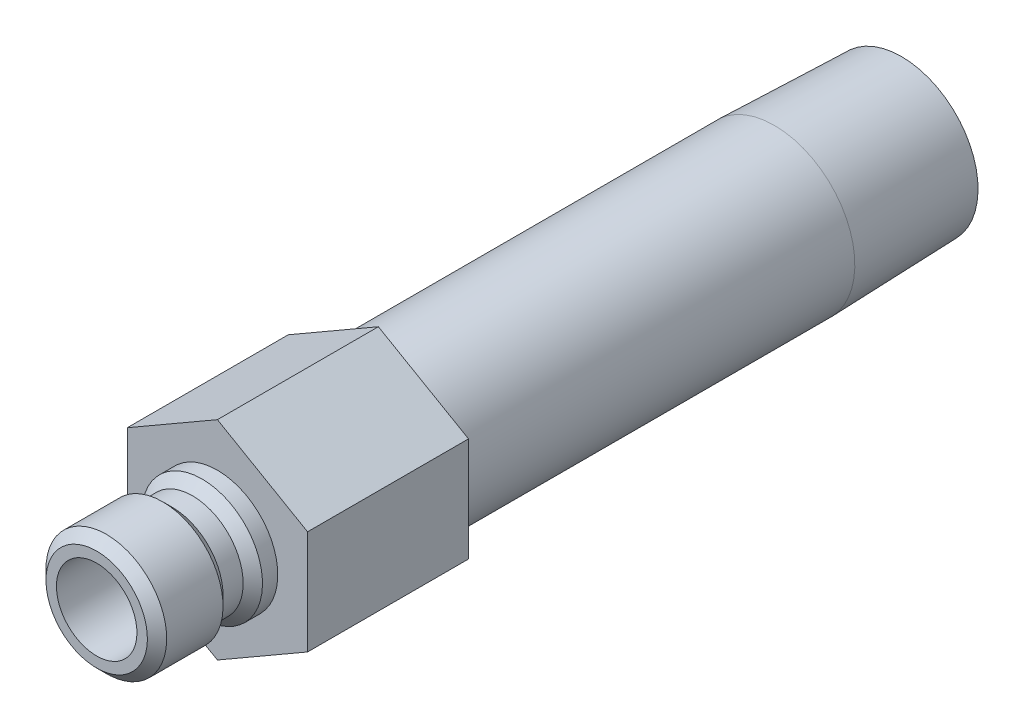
from build123d import *

# Parameters (mm, degrees)
SKETCH2_R           = 3.175
BOSS_EXTRUDE1_DEPTH = 12.7


with BuildPart() as part:
    # Sketch1 → Revolve1 (revolve)
    with BuildSketch(Plane(origin=(0, 0, 0), x_dir=(0, 0, -1), z_dir=(1, 0, 0))):
        Polygon((-9.525, 3.175), (-9.525, 4.0005), (-8.763, 4.7625), (-4.318, 4.7625), (-3.556, 4.0005), (-1.9685, 4.0005), (-1.2065, 4.7625), (0, 4.7625), (0, 6.35), (43.942, 6.35), (53.975, 6.036470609), (53.975, 4.6228), (12.7, 4.6228), (12.7, 3.175), align=None)
    revolve(axis=Axis((0, 0, 0), (0, 0, 1)))

    # Sketch2 → Boss-Extrude1 (add)
    with BuildSketch(Plane.XY):
        Polygon((-7.112, 4.106115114), (-7.112, -4.106115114), (0, -8.212230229), (7.112, -4.106115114), (7.112, 4.106115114), (0, 8.212230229), align=None)
        with Locations(Location((0, 0, 0), (0, 0, 90))):
            Circle(SKETCH2_R, mode=Mode.SUBTRACT)
    extrude(amount=-BOSS_EXTRUDE1_DEPTH)


solid = part.part
